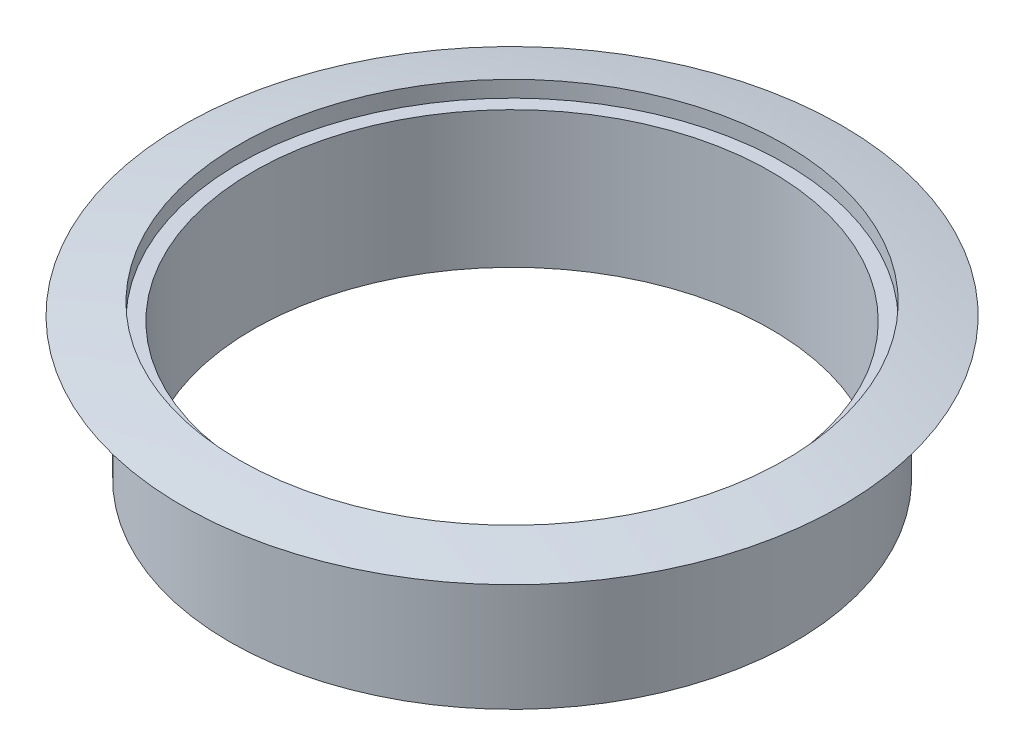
ISO-10303-21;
HEADER;
FILE_DESCRIPTION(('STEP AP214'),'2;1');
FILE_NAME('part.step','',(''),(''),'','','');
FILE_SCHEMA(('AUTOMOTIVE_DESIGN { 1 0 10303 214 1 1 1 1 }'));
ENDSEC;
DATA;
#1=APPLICATION_CONTEXT('core data for automotive mechanical design processes');
#2=APPLICATION_PROTOCOL_DEFINITION('international standard','automotive_design',2000,#1);
#3=PRODUCT_CONTEXT('',#1,'mechanical');
#4=PRODUCT('Part','Part','',(#3));
#5=PRODUCT_RELATED_PRODUCT_CATEGORY('part','',(#4));
#6=PRODUCT_DEFINITION_FORMATION('','',#4);
#7=PRODUCT_DEFINITION_CONTEXT('part definition',#1,'design');
#8=PRODUCT_DEFINITION('design','',#6,#7);
#9=PRODUCT_DEFINITION_SHAPE('','',#8);
#10=(LENGTH_UNIT() NAMED_UNIT(*) SI_UNIT(.MILLI.,.METRE.));
#11=(NAMED_UNIT(*) PLANE_ANGLE_UNIT() SI_UNIT($,.RADIAN.));
#12=(NAMED_UNIT(*) SI_UNIT($,.STERADIAN.) SOLID_ANGLE_UNIT());
#13=UNCERTAINTY_MEASURE_WITH_UNIT(LENGTH_MEASURE(1.E-05),#10,'distance_accuracy_value','');
#14=(GEOMETRIC_REPRESENTATION_CONTEXT(3) GLOBAL_UNCERTAINTY_ASSIGNED_CONTEXT((#13)) GLOBAL_UNIT_ASSIGNED_CONTEXT((#10,
#11,#12)) REPRESENTATION_CONTEXT('',''));
#15=CARTESIAN_POINT('',(0.,0.,0.));
#16=DIRECTION('',(0.,0.,1.));
#17=DIRECTION('',(1.,0.,0.));
#18=AXIS2_PLACEMENT_3D('',#15,#16,#17);
#19=CARTESIAN_POINT('',(0.,-15.,0.));
#20=DIRECTION('',(0.,1.,0.));
#21=DIRECTION('',(0.,0.,1.));
#22=AXIS2_PLACEMENT_3D('',#19,#20,#21);
#23=CYLINDRICAL_SURFACE('',#22,27.5);
#24=CARTESIAN_POINT('',(0.,-15.,0.));
#25=DIRECTION('',(0.,1.,0.));
#26=DIRECTION('',(0.,0.,1.));
#27=AXIS2_PLACEMENT_3D('',#24,#25,#26);
#28=CIRCLE('',#27,27.5);
#29=CARTESIAN_POINT('',(0.,-15.,27.5));
#30=VERTEX_POINT('',#29);
#31=EDGE_CURVE('E41',#30,#30,#28,.T.);
#32=ORIENTED_EDGE('',*,*,#31,.F.);
#33=EDGE_LOOP('',(#32));
#34=FACE_BOUND('',#33,.T.);
#35=CARTESIAN_POINT('',(0.,-0.499999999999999,0.));
#36=DIRECTION('',(0.,1.,0.));
#37=DIRECTION('',(0.,0.,1.));
#38=AXIS2_PLACEMENT_3D('',#35,#36,#37);
#39=CIRCLE('',#38,27.5);
#40=CARTESIAN_POINT('',(0.,-0.499999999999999,27.5));
#41=VERTEX_POINT('',#40);
#42=EDGE_CURVE('E32',#41,#41,#39,.F.);
#43=ORIENTED_EDGE('',*,*,#42,.F.);
#44=EDGE_LOOP('',(#43));
#45=FACE_BOUND('',#44,.T.);
#46=ADVANCED_FACE('F28',(#34,#45),#23,.F.);
#47=CARTESIAN_POINT('',(0.,-15.,0.));
#48=DIRECTION('',(0.,1.,0.));
#49=DIRECTION('',(0.,0.,1.));
#50=AXIS2_PLACEMENT_3D('',#47,#48,#49);
#51=CYLINDRICAL_SURFACE('',#50,30.);
#52=CARTESIAN_POINT('',(0.,-15.,0.));
#53=DIRECTION('',(0.,1.,0.));
#54=DIRECTION('',(0.,0.,1.));
#55=AXIS2_PLACEMENT_3D('',#52,#53,#54);
#56=CIRCLE('',#55,30.);
#57=CARTESIAN_POINT('',(0.,-15.,30.));
#58=VERTEX_POINT('',#57);
#59=EDGE_CURVE('E10',#58,#58,#56,.T.);
#60=ORIENTED_EDGE('',*,*,#59,.T.);
#61=EDGE_LOOP('',(#60));
#62=FACE_BOUND('',#61,.T.);
#63=CARTESIAN_POINT('',(0.,0.,0.));
#64=DIRECTION('',(0.,1.,0.));
#65=DIRECTION('',(0.,0.,1.));
#66=AXIS2_PLACEMENT_3D('',#63,#64,#65);
#67=CIRCLE('',#66,30.);
#68=CARTESIAN_POINT('',(0.,0.,30.));
#69=VERTEX_POINT('',#68);
#70=EDGE_CURVE('E36',#69,#69,#67,.T.);
#71=ORIENTED_EDGE('',*,*,#70,.F.);
#72=EDGE_LOOP('',(#71));
#73=FACE_BOUND('',#72,.T.);
#74=ADVANCED_FACE('F30',(#62,#73),#51,.T.);
#75=CARTESIAN_POINT('',(0.,-15.,0.));
#76=DIRECTION('',(0.,1.,0.));
#77=DIRECTION('',(0.,0.,1.));
#78=AXIS2_PLACEMENT_3D('',#75,#76,#77);
#79=PLANE('',#78);
#80=ORIENTED_EDGE('',*,*,#31,.T.);
#81=EDGE_LOOP('',(#80));
#82=FACE_BOUND('',#81,.T.);
#83=ORIENTED_EDGE('',*,*,#59,.F.);
#84=EDGE_LOOP('',(#83));
#85=FACE_BOUND('',#84,.T.);
#86=ADVANCED_FACE('F62',(#82,#85),#79,.F.);
#87=CARTESIAN_POINT('',(0.,0.,27.5));
#88=DIRECTION('',(0.,1.,0.));
#89=DIRECTION('',(0.,0.,1.));
#90=AXIS2_PLACEMENT_3D('',#87,#88,#89);
#91=PLANE('',#90);
#92=ORIENTED_EDGE('',*,*,#70,.T.);
#93=EDGE_LOOP('',(#92));
#94=FACE_BOUND('',#93,.T.);
#95=CARTESIAN_POINT('',(0.,0.,0.));
#96=DIRECTION('',(0.,-1.,0.));
#97=DIRECTION('',(0.,0.,-1.));
#98=AXIS2_PLACEMENT_3D('',#95,#96,#97);
#99=CIRCLE('',#98,35.);
#100=CARTESIAN_POINT('',(0.,0.,-35.));
#101=VERTEX_POINT('',#100);
#102=EDGE_CURVE('E51',#101,#101,#99,.T.);
#103=ORIENTED_EDGE('',*,*,#102,.T.);
#104=EDGE_LOOP('',(#103));
#105=FACE_BOUND('',#104,.T.);
#106=ADVANCED_FACE('F82',(#94,#105),#91,.F.);
#107=CARTESIAN_POINT('',(0.,-161.122577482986,0.));
#108=DIRECTION('',(0.,-1.,0.));
#109=DIRECTION('',(0.,0.,-1.));
#110=AXIS2_PLACEMENT_3D('',#107,#108,#109);
#111=DEGENERATE_TOROIDAL_SURFACE('',#110,1.12451549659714,165.122577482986,.F.);
#112=CARTESIAN_POINT('',(0.,1.2288289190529,0.));
#113=DIRECTION('',(0.,-1.,0.));
#114=DIRECTION('',(0.,0.,-1.));
#115=AXIS2_PLACEMENT_3D('',#112,#113,#114);
#116=CIRCLE('',#115,29.);
#117=CARTESIAN_POINT('',(0.,1.2288289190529,-29.));
#118=VERTEX_POINT('',#117);
#119=EDGE_CURVE('E45',#118,#118,#116,.T.);
#120=ORIENTED_EDGE('',*,*,#119,.T.);
#121=EDGE_LOOP('',(#120));
#122=FACE_BOUND('',#121,.T.);
#123=ORIENTED_EDGE('',*,*,#102,.F.);
#124=EDGE_LOOP('',(#123));
#125=FACE_BOUND('',#124,.T.);
#126=ADVANCED_FACE('F73',(#122,#125),#111,.F.);
#127=CARTESIAN_POINT('',(0.,-0.499999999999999,0.));
#128=DIRECTION('',(0.,1.,0.));
#129=DIRECTION('',(0.,0.,1.));
#130=AXIS2_PLACEMENT_3D('',#127,#128,#129);
#131=PLANE('',#130);
#132=CARTESIAN_POINT('',(0.,-0.499999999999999,0.));
#133=DIRECTION('',(0.,1.,0.));
#134=DIRECTION('',(0.,0.,1.));
#135=AXIS2_PLACEMENT_3D('',#132,#133,#134);
#136=CIRCLE('',#135,29.);
#137=CARTESIAN_POINT('',(0.,-0.499999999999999,29.));
#138=VERTEX_POINT('',#137);
#139=EDGE_CURVE('E47',#138,#138,#136,.T.);
#140=ORIENTED_EDGE('',*,*,#139,.T.);
#141=EDGE_LOOP('',(#140));
#142=FACE_BOUND('',#141,.T.);
#143=ORIENTED_EDGE('',*,*,#42,.T.);
#144=EDGE_LOOP('',(#143));
#145=FACE_BOUND('',#144,.T.);
#146=ADVANCED_FACE('F70',(#142,#145),#131,.T.);
#147=CARTESIAN_POINT('',(0.,-0.499999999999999,0.));
#148=DIRECTION('',(0.,1.,0.));
#149=DIRECTION('',(0.,0.,1.));
#150=AXIS2_PLACEMENT_3D('',#147,#148,#149);
#151=CYLINDRICAL_SURFACE('',#150,29.);
#152=ORIENTED_EDGE('',*,*,#139,.F.);
#153=EDGE_LOOP('',(#152));
#154=FACE_BOUND('',#153,.T.);
#155=ORIENTED_EDGE('',*,*,#119,.F.);
#156=EDGE_LOOP('',(#155));
#157=FACE_BOUND('',#156,.T.);
#158=ADVANCED_FACE('F72',(#154,#157),#151,.F.);
#159=CLOSED_SHELL('',(#46,#74,#86,#106,#126,#146,#158));
#160=MANIFOLD_SOLID_BREP('B2',#159);
#161=ADVANCED_BREP_SHAPE_REPRESENTATION('',(#18,#160),#14);
#162=SHAPE_DEFINITION_REPRESENTATION(#9,#161);
ENDSEC;
END-ISO-10303-21;
